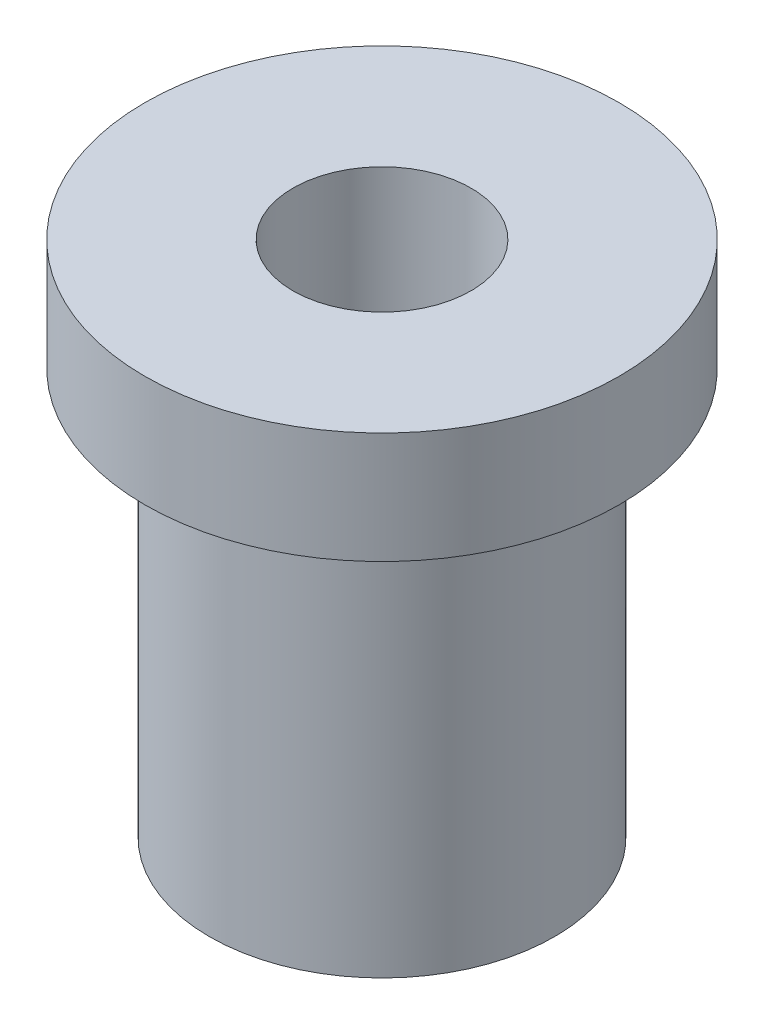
from build123d import *

# Parameters (mm, degrees)
ESQUISSE1_R        = 3.1
ESQUISSE1_R_2      = 1.6
BOSS_EXTRU_1_DEPTH = 7.3
ESQUISSE2_R        = 4.26
ESQUISSE2_R_2      = 1.6
BOSS_EXTRU_2_DEPTH = 2


with BuildPart() as part:
    # Esquisse1 → Boss.-Extru.1 (new body)
    with BuildSketch(Plane(origin=(0, 0, 0), x_dir=(1, 0, 0), z_dir=(0, 1, 0))):
        with Locations(Location((0, 0, 0), (0, 0, 270))):
            Circle(ESQUISSE1_R)
        with Locations(Location((0, 0, 0), (0, 0, 270))):
            Circle(ESQUISSE1_R_2, mode=Mode.SUBTRACT)
    extrude(amount=BOSS_EXTRU_1_DEPTH)

    # Esquisse2 → Boss.-Extru.2 (add)
    with BuildSketch(Plane(origin=(0, 7.3, 0), x_dir=(1, 0, 0), z_dir=(0, 1, 0))):
        with Locations(Location((0, 0, 0), (0, 0, 270))):
            Circle(ESQUISSE2_R)
        with Locations(Location((0, 0, 0), (0, 0, 270))):
            Circle(ESQUISSE2_R_2, mode=Mode.SUBTRACT)
    extrude(amount=BOSS_EXTRU_2_DEPTH)


solid = part.part
